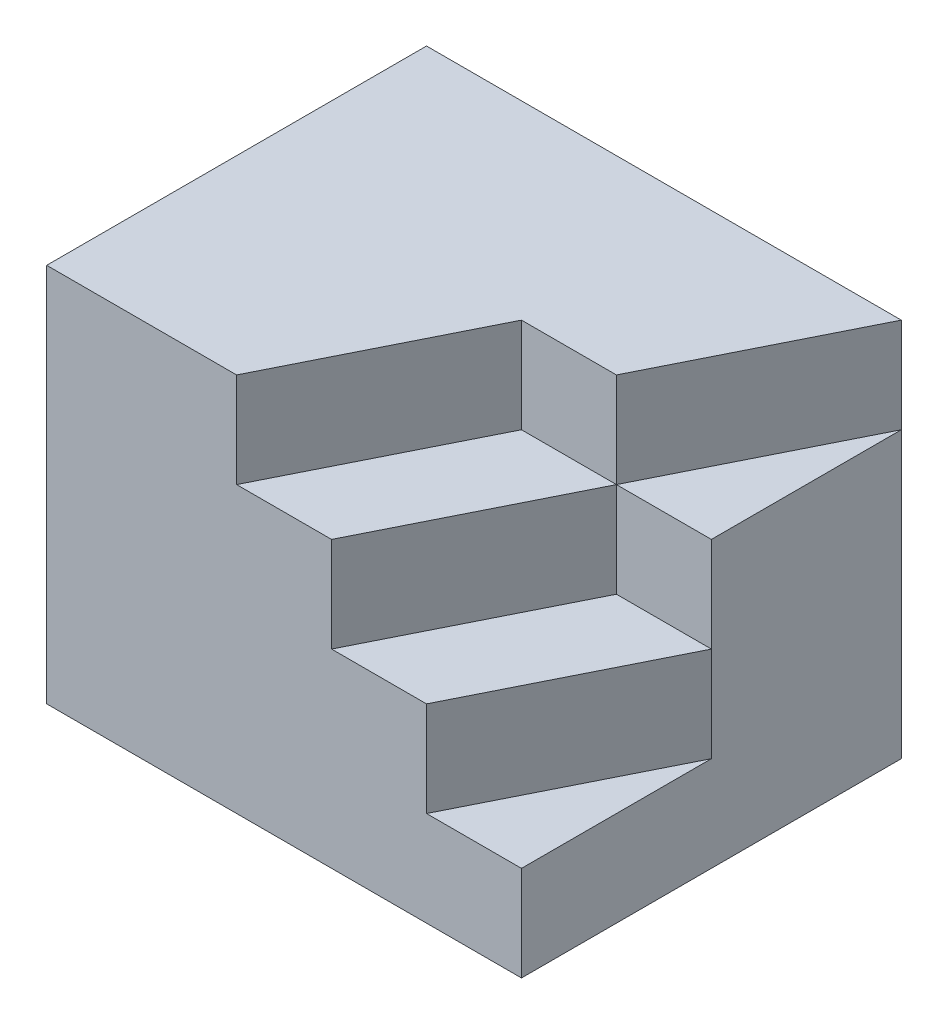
from build123d import *

# Parameters (mm, degrees)
SKETCH1_W      = 50
SKETCH1_H      = 40
EXTRUDE1_DEPTH = 40
EXTRUDE3_DEPTH = 10
EXTRUDE5_DEPTH = 20
EXTRUDE6_DEPTH = 30


with BuildPart() as part:
    # Sketch1 → Extrude1 (new body)
    with BuildSketch(Plane(origin=(0, 0, 0), x_dir=(1, 0, 0), z_dir=(0, 1, 0))):
        Rectangle(SKETCH1_W, SKETCH1_H)
    extrude(amount=EXTRUDE1_DEPTH)

    # Sketch2 → Extrude3 (cut)
    with BuildSketch(Plane(origin=(0, 40, 0), x_dir=(1, 0, 0), z_dir=(0, 1, 0))):
        Polygon((5, -20), (15, 0), (5, 0), (-5, -20), align=None)
        Polygon((25, 0), (15, 0), (5, -20), (15, -20), align=None)
        Polygon((25, 0), (25, 20), (15, 0), align=None)
        Polygon((25, -20), (25, 0), (15, -20), align=None)
    extrude(amount=-EXTRUDE3_DEPTH, mode=Mode.SUBTRACT)

    # Sketch → Extrude5 (cut)
    with BuildSketch(Plane(origin=(0, 40, 0), x_dir=(1, 0, 0), z_dir=(0, 1, 0))):
        Polygon((25, 0), (15, 0), (5, -20), (15, -20), align=None)
        Polygon((25, -20), (25, 0), (15, -20), align=None)
    extrude(amount=-EXTRUDE5_DEPTH, mode=Mode.SUBTRACT)

    # Sketch 2 → Extrude6 (cut)
    with BuildSketch(Plane(origin=(0, 40, 0), x_dir=(1, 0, 0), z_dir=(0, 1, 0))):
        Polygon((25, -20), (25, 0), (15, -20), align=None)
    extrude(amount=-EXTRUDE6_DEPTH, mode=Mode.SUBTRACT)


solid = part.part
